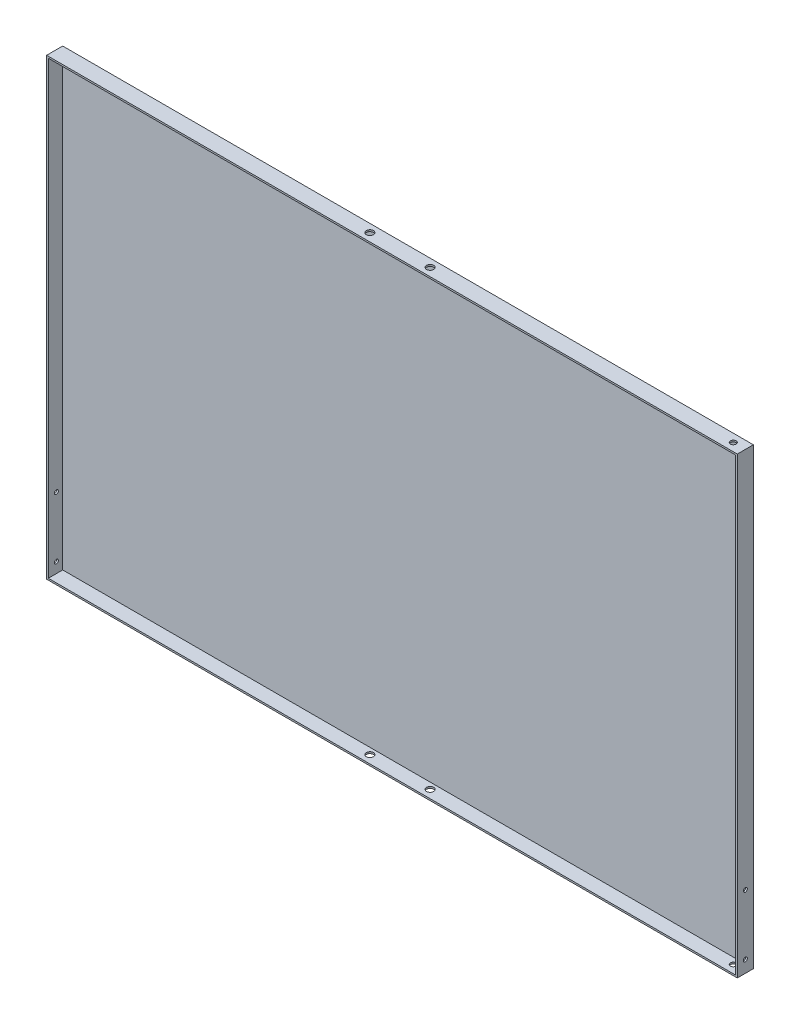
from build123d import *

# Parameters (mm, degrees)
ESQUISSE1_W                  = 1720
ESQUISSE1_H                  = 1130
BOSS_EXTRU_1_DEPTH           = 40
COQUE1_T                     = -4.224360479
ESQUISSE2_R                  = 7.180212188
ESQUISSE2_R_2                = 8.952519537
ENL_V_MAT_EXTRU_1_DEPTH      = 1421.598465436
ENL_V_MAT_EXTRU_2_DEPTH      = 1811.863053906
ENL_V_MAT_EXTRU_2_DEPTH_BACK = 1811.863053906
ESQUISSE3_R                  = 5


with BuildPart() as part:
    # Esquisse1 → Boss.-Extru.1 (new body)
    with BuildSketch(Plane.XY):
        Rectangle(ESQUISSE1_W, ESQUISSE1_H)
    extrude(amount=BOSS_EXTRU_1_DEPTH)

    # Coque1
    coque1_openings = [part.faces().sort_by_distance(p)[0] for p in [
        (0, 0, 40),
    ]]
    offset(amount=COQUE1_T, openings=coque1_openings, kind=Kind.INTERSECTION)

    # Esquisse2 → Enl_v. mat.-Extru.1 (cut, through all)
    with BuildSketch(Plane(origin=(0, 565, 0), x_dir=(1, 0, 0), z_dir=(0, 1, 0))):
        with Locations(Location((830, -20, 0), (0, 0, 180))):
            Circle(ESQUISSE2_R)
        with Locations(Location((-75, -20, 0), (0, 0, 180))):
            Circle(ESQUISSE2_R_2)
        with Locations((75, -20)):
            Circle(ESQUISSE2_R_2)
    extrude(amount=-ENL_V_MAT_EXTRU_1_DEPTH, mode=Mode.SUBTRACT)

    # Esquisse3 → Enl_v. mat.-Extru.2 (cut, two sides: drawn at the far end of the back side and taken through both)
    with BuildSketch(Plane.ZY.offset(860).offset(-ENL_V_MAT_EXTRU_2_DEPTH_BACK)):
        with Locations((20, -535)):
            Circle(ESQUISSE3_R)
        with Locations((20, -385)):
            Circle(ESQUISSE3_R)
    extrude(amount=ENL_V_MAT_EXTRU_2_DEPTH + ENL_V_MAT_EXTRU_2_DEPTH_BACK, mode=Mode.SUBTRACT)


solid = part.part
